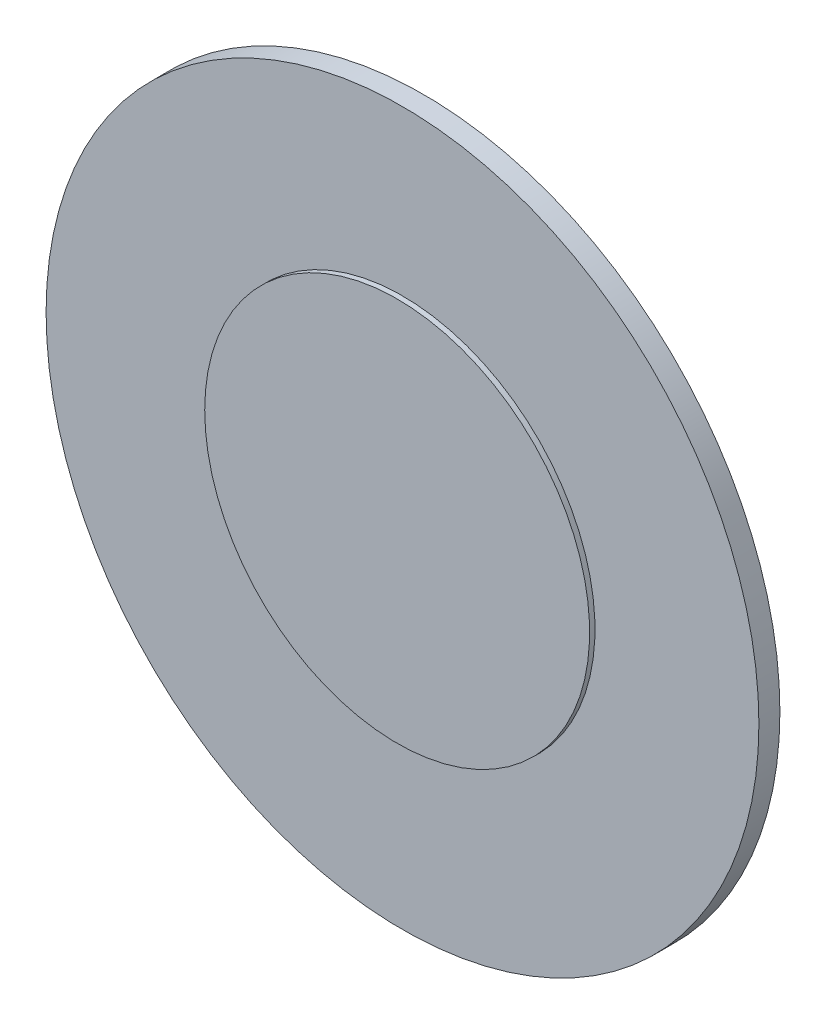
ISO-10303-21;
HEADER;
FILE_DESCRIPTION(('STEP AP214'),'2;1');
FILE_NAME('part.step','',(''),(''),'','','');
FILE_SCHEMA(('AUTOMOTIVE_DESIGN { 1 0 10303 214 1 1 1 1 }'));
ENDSEC;
DATA;
#1=APPLICATION_CONTEXT('core data for automotive mechanical design processes');
#2=APPLICATION_PROTOCOL_DEFINITION('international standard','automotive_design',2000,#1);
#3=PRODUCT_CONTEXT('',#1,'mechanical');
#4=PRODUCT('Part','Part','',(#3));
#5=PRODUCT_RELATED_PRODUCT_CATEGORY('part','',(#4));
#6=PRODUCT_DEFINITION_FORMATION('','',#4);
#7=PRODUCT_DEFINITION_CONTEXT('part definition',#1,'design');
#8=PRODUCT_DEFINITION('design','',#6,#7);
#9=PRODUCT_DEFINITION_SHAPE('','',#8);
#10=(LENGTH_UNIT() NAMED_UNIT(*) SI_UNIT(.MILLI.,.METRE.));
#11=(NAMED_UNIT(*) PLANE_ANGLE_UNIT() SI_UNIT($,.RADIAN.));
#12=(NAMED_UNIT(*) SI_UNIT($,.STERADIAN.) SOLID_ANGLE_UNIT());
#13=UNCERTAINTY_MEASURE_WITH_UNIT(LENGTH_MEASURE(1.E-05),#10,'distance_accuracy_value','');
#14=(GEOMETRIC_REPRESENTATION_CONTEXT(3) GLOBAL_UNCERTAINTY_ASSIGNED_CONTEXT((#13)) GLOBAL_UNIT_ASSIGNED_CONTEXT((#10,
#11,#12)) REPRESENTATION_CONTEXT('',''));
#15=CARTESIAN_POINT('',(0.,0.,0.));
#16=DIRECTION('',(0.,0.,1.));
#17=DIRECTION('',(1.,0.,0.));
#18=AXIS2_PLACEMENT_3D('',#15,#16,#17);
#19=CARTESIAN_POINT('',(0.,-1.94289029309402E-13,0.299999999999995));
#20=DIRECTION('',(0.,0.,0.999999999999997));
#21=DIRECTION('',(0.999999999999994,0.,0.));
#22=AXIS2_PLACEMENT_3D('',#19,#20,#21);
#23=PLANE('',#22);
#24=CARTESIAN_POINT('',(0.,-1.94289029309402E-13,0.299999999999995));
#25=DIRECTION('',(0.,0.,0.999999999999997));
#26=DIRECTION('',(0.999999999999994,0.,0.));
#27=AXIS2_PLACEMENT_3D('',#24,#25,#26);
#28=CIRCLE('',#27,5.0927);
#29=CARTESIAN_POINT('',(-5.09269999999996,-1.92875521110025E-13,0.299999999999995));
#30=VERTEX_POINT('',#29);
#31=EDGE_CURVE('E10',#30,#30,#28,.T.);
#32=ORIENTED_EDGE('',*,*,#31,.T.);
#33=EDGE_LOOP('',(#32));
#34=FACE_BOUND('',#33,.T.);
#35=CARTESIAN_POINT('',(0.,-1.94289029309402E-13,0.299999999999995));
#36=DIRECTION('',(0.,0.,0.999999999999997));
#37=DIRECTION('',(0.999999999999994,0.,0.));
#38=AXIS2_PLACEMENT_3D('',#35,#36,#37);
#39=CIRCLE('',#38,2.75);
#40=CARTESIAN_POINT('',(-2.74999999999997,-1.93525750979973E-13,0.299999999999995));
#41=VERTEX_POINT('',#40);
#42=EDGE_CURVE('E41',#41,#41,#39,.T.);
#43=ORIENTED_EDGE('',*,*,#42,.F.);
#44=EDGE_LOOP('',(#43));
#45=FACE_BOUND('',#44,.T.);
#46=ADVANCED_FACE('F28',(#34,#45),#23,.T.);
#47=CARTESIAN_POINT('',(0.,-1.94289029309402E-13,0.299999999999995));
#48=DIRECTION('',(0.,0.,-0.999999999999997));
#49=DIRECTION('',(-0.999999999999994,0.,0.));
#50=AXIS2_PLACEMENT_3D('',#47,#48,#49);
#51=CYLINDRICAL_SURFACE('',#50,5.0927);
#52=CARTESIAN_POINT('',(0.,-1.94289029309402E-13,0.));
#53=DIRECTION('',(0.,0.,0.999999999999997));
#54=DIRECTION('',(0.999999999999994,0.,0.));
#55=AXIS2_PLACEMENT_3D('',#52,#53,#54);
#56=CIRCLE('',#55,5.0927);
#57=CARTESIAN_POINT('',(-5.09269999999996,-1.92875521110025E-13,0.));
#58=VERTEX_POINT('',#57);
#59=EDGE_CURVE('E32',#58,#58,#56,.T.);
#60=CARTESIAN_POINT('',(-5.09269999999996,-1.92875521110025E-13,0.299999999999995));
#61=CARTESIAN_POINT('',(-5.09269999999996,-1.92875521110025E-13,0.296874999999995));
#62=CARTESIAN_POINT('',(-5.09269999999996,-1.92875521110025E-13,0.293749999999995));
#63=CARTESIAN_POINT('',(-5.09269999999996,-1.92875521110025E-13,0.287499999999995));
#64=CARTESIAN_POINT('',(-5.09269999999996,-1.92875521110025E-13,0.284374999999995));
#65=CARTESIAN_POINT('',(-5.09269999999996,-1.92875521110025E-13,0.278124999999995));
#66=CARTESIAN_POINT('',(-5.09269999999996,-1.92875521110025E-13,0.274999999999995));
#67=CARTESIAN_POINT('',(-5.09269999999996,-1.92875521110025E-13,0.268749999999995));
#68=CARTESIAN_POINT('',(-5.09269999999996,-1.92875521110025E-13,0.265624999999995));
#69=CARTESIAN_POINT('',(-5.09269999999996,-1.92875521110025E-13,0.259374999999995));
#70=CARTESIAN_POINT('',(-5.09269999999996,-1.92875521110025E-13,0.256249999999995));
#71=CARTESIAN_POINT('',(-5.09269999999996,-1.92875521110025E-13,0.249999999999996));
#72=CARTESIAN_POINT('',(-5.09269999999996,-1.92875521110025E-13,0.246874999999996));
#73=CARTESIAN_POINT('',(-5.09269999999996,-1.92875521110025E-13,0.240624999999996));
#74=CARTESIAN_POINT('',(-5.09269999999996,-1.92875521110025E-13,0.237499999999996));
#75=CARTESIAN_POINT('',(-5.09269999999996,-1.92875521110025E-13,0.231249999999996));
#76=CARTESIAN_POINT('',(-5.09269999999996,-1.92875521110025E-13,0.228124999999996));
#77=CARTESIAN_POINT('',(-5.09269999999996,-1.92875521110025E-13,0.221874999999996));
#78=CARTESIAN_POINT('',(-5.09269999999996,-1.92875521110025E-13,0.218749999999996));
#79=CARTESIAN_POINT('',(-5.09269999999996,-1.92875521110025E-13,0.212499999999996));
#80=CARTESIAN_POINT('',(-5.09269999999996,-1.92875521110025E-13,0.209374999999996));
#81=CARTESIAN_POINT('',(-5.09269999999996,-1.92875521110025E-13,0.203124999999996));
#82=CARTESIAN_POINT('',(-5.09269999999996,-1.92875521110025E-13,0.199999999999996));
#83=CARTESIAN_POINT('',(-5.09269999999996,-1.92875521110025E-13,0.193749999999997));
#84=CARTESIAN_POINT('',(-5.09269999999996,-1.92875521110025E-13,0.190624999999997));
#85=CARTESIAN_POINT('',(-5.09269999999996,-1.92875521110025E-13,0.184374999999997));
#86=CARTESIAN_POINT('',(-5.09269999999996,-1.92875521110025E-13,0.181249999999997));
#87=CARTESIAN_POINT('',(-5.09269999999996,-1.92875521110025E-13,0.174999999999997));
#88=CARTESIAN_POINT('',(-5.09269999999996,-1.92875521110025E-13,0.171874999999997));
#89=CARTESIAN_POINT('',(-5.09269999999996,-1.92875521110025E-13,0.165624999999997));
#90=CARTESIAN_POINT('',(-5.09269999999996,-1.92875521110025E-13,0.162499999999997));
#91=CARTESIAN_POINT('',(-5.09269999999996,-1.92875521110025E-13,0.156249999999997));
#92=CARTESIAN_POINT('',(-5.09269999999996,-1.92875521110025E-13,0.153124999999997));
#93=CARTESIAN_POINT('',(-5.09269999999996,-1.92875521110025E-13,0.146874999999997));
#94=CARTESIAN_POINT('',(-5.09269999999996,-1.92875521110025E-13,0.143749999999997));
#95=CARTESIAN_POINT('',(-5.09269999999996,-1.92875521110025E-13,0.137499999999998));
#96=CARTESIAN_POINT('',(-5.09269999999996,-1.92875521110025E-13,0.134374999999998));
#97=CARTESIAN_POINT('',(-5.09269999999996,-1.92875521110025E-13,0.128124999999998));
#98=CARTESIAN_POINT('',(-5.09269999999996,-1.92875521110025E-13,0.124999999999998));
#99=CARTESIAN_POINT('',(-5.09269999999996,-1.92875521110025E-13,0.118749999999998));
#100=CARTESIAN_POINT('',(-5.09269999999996,-1.92875521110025E-13,0.115624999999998));
#101=CARTESIAN_POINT('',(-5.09269999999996,-1.92875521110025E-13,0.109374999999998));
#102=CARTESIAN_POINT('',(-5.09269999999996,-1.92875521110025E-13,0.106249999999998));
#103=CARTESIAN_POINT('',(-5.09269999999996,-1.92875521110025E-13,0.0999999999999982));
#104=CARTESIAN_POINT('',(-5.09269999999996,-1.92875521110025E-13,0.0968749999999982));
#105=CARTESIAN_POINT('',(-5.09269999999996,-1.92875521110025E-13,0.0906249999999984));
#106=CARTESIAN_POINT('',(-5.09269999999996,-1.92875521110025E-13,0.0874999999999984));
#107=CARTESIAN_POINT('',(-5.09269999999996,-1.92875521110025E-13,0.0812499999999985));
#108=CARTESIAN_POINT('',(-5.09269999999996,-1.92875521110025E-13,0.0781249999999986));
#109=CARTESIAN_POINT('',(-5.09269999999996,-1.92875521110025E-13,0.0718749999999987));
#110=CARTESIAN_POINT('',(-5.09269999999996,-1.92875521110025E-13,0.0687499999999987));
#111=CARTESIAN_POINT('',(-5.09269999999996,-1.92875521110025E-13,0.0624999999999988));
#112=CARTESIAN_POINT('',(-5.09269999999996,-1.92875521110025E-13,0.0593749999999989));
#113=CARTESIAN_POINT('',(-5.09269999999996,-1.92875521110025E-13,0.053124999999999));
#114=CARTESIAN_POINT('',(-5.09269999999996,-1.92875521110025E-13,0.0499999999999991));
#115=CARTESIAN_POINT('',(-5.09269999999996,-1.92875521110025E-13,0.0437499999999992));
#116=CARTESIAN_POINT('',(-5.09269999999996,-1.92875521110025E-13,0.0406249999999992));
#117=CARTESIAN_POINT('',(-5.09269999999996,-1.92875521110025E-13,0.0343749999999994));
#118=CARTESIAN_POINT('',(-5.09269999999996,-1.92875521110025E-13,0.0312499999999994));
#119=CARTESIAN_POINT('',(-5.09269999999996,-1.92875521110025E-13,0.0249999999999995));
#120=CARTESIAN_POINT('',(-5.09269999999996,-1.92875521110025E-13,0.0218749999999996));
#121=CARTESIAN_POINT('',(-5.09269999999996,-1.92875521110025E-13,0.0156249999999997));
#122=CARTESIAN_POINT('',(-5.09269999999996,-1.92875521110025E-13,0.0124999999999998));
#123=CARTESIAN_POINT('',(-5.09269999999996,-1.92875521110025E-13,0.00624999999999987));
#124=CARTESIAN_POINT('',(-5.09269999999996,-1.92875521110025E-13,0.00312499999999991));
#125=CARTESIAN_POINT('',(-5.09269999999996,-1.92875521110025E-13,0.));
#126=B_SPLINE_CURVE_WITH_KNOTS('',3,(#60,#61,#62,#63,#64,#65,#66,#67,#68,#69,#70,#71,#72,#73,
#74,#75,#76,#77,#78,#79,#80,#81,#82,#83,#84,#85,#86,#87,#88,#89,#90,#91,#92,#93,#94,#95,#96,#97,
#98,#99,#100,#101,#102,#103,#104,#105,#106,#107,#108,#109,#110,#111,#112,#113,#114,#115,#116,
#117,#118,#119,#120,#121,#122,#123,#124,#125),.UNSPECIFIED.,.F.,.F.,(4,2,2,2,2,2,2,2,2,2,2,2,2,
2,2,2,2,2,2,2,2,2,2,2,2,2,2,2,2,2,2,2,4),(0.,0.00937499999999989,0.0187499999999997,
0.0281249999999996,0.0374999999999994,0.0468749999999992,0.056249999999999,0.0656249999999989,
0.0749999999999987,0.0843749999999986,0.0937499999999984,0.103124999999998,0.112499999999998,
0.121874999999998,0.131249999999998,0.140624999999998,0.149999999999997,0.159374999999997,
0.168749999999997,0.178124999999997,0.187499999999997,0.196874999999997,0.206249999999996,
0.215624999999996,0.224999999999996,0.234374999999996,0.243749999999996,0.253124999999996,
0.262499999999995,0.271874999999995,0.281249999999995,0.290624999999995,0.299999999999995),.UNSPECIFIED.);
#127=EDGE_CURVE('BSEAM30',#30,#58,#126,.T.);
#128=ORIENTED_EDGE('',*,*,#31,.F.);
#129=ORIENTED_EDGE('',*,*,#59,.T.);
#130=ORIENTED_EDGE('',*,*,#127,.T.);
#131=ORIENTED_EDGE('',*,*,#127,.F.);
#132=EDGE_LOOP('',(#128,#130,#129,#131));
#133=FACE_BOUND('',#132,.T.);
#134=ADVANCED_FACE('F30',(#133),#51,.T.);
#135=CARTESIAN_POINT('',(0.,-1.94289029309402E-13,0.));
#136=DIRECTION('',(0.,0.,0.999999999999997));
#137=DIRECTION('',(0.999999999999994,0.,0.));
#138=AXIS2_PLACEMENT_3D('',#135,#136,#137);
#139=PLANE('',#138);
#140=ORIENTED_EDGE('',*,*,#59,.F.);
#141=EDGE_LOOP('',(#140));
#142=FACE_BOUND('',#141,.T.);
#143=ADVANCED_FACE('F52',(#142),#139,.F.);
#144=CARTESIAN_POINT('',(0.,-1.94289029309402E-13,0.376199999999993));
#145=DIRECTION('',(0.,0.,-0.999999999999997));
#146=DIRECTION('',(-0.999999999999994,0.,0.));
#147=AXIS2_PLACEMENT_3D('',#144,#145,#146);
#148=CYLINDRICAL_SURFACE('',#147,2.75);
#149=CARTESIAN_POINT('',(0.,-1.94289029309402E-13,0.376199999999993));
#150=DIRECTION('',(0.,0.,0.999999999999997));
#151=DIRECTION('',(0.999999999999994,0.,0.));
#152=AXIS2_PLACEMENT_3D('',#149,#150,#151);
#153=CIRCLE('',#152,2.75);
#154=CARTESIAN_POINT('',(-2.74999999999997,-1.93525750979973E-13,0.376199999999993));
#155=VERTEX_POINT('',#154);
#156=EDGE_CURVE('E39',#155,#155,#153,.T.);
#157=CARTESIAN_POINT('',(-2.74999999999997,-1.93525750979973E-13,0.376199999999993));
#158=CARTESIAN_POINT('',(-2.74999999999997,-1.93525750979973E-13,0.375406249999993));
#159=CARTESIAN_POINT('',(-2.74999999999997,-1.93525750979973E-13,0.374612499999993));
#160=CARTESIAN_POINT('',(-2.74999999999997,-1.93525750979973E-13,0.373024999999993));
#161=CARTESIAN_POINT('',(-2.74999999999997,-1.93525750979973E-13,0.372231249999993));
#162=CARTESIAN_POINT('',(-2.74999999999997,-1.93525750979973E-13,0.370643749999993));
#163=CARTESIAN_POINT('',(-2.74999999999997,-1.93525750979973E-13,0.369849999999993));
#164=CARTESIAN_POINT('',(-2.74999999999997,-1.93525750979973E-13,0.368262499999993));
#165=CARTESIAN_POINT('',(-2.74999999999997,-1.93525750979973E-13,0.367468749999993));
#166=CARTESIAN_POINT('',(-2.74999999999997,-1.93525750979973E-13,0.365881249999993));
#167=CARTESIAN_POINT('',(-2.74999999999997,-1.93525750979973E-13,0.365087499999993));
#168=CARTESIAN_POINT('',(-2.74999999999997,-1.93525750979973E-13,0.363499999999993));
#169=CARTESIAN_POINT('',(-2.74999999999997,-1.93525750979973E-13,0.362706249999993));
#170=CARTESIAN_POINT('',(-2.74999999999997,-1.93525750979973E-13,0.361118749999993));
#171=CARTESIAN_POINT('',(-2.74999999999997,-1.93525750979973E-13,0.360324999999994));
#172=CARTESIAN_POINT('',(-2.74999999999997,-1.93525750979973E-13,0.358737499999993));
#173=CARTESIAN_POINT('',(-2.74999999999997,-1.93525750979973E-13,0.357943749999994));
#174=CARTESIAN_POINT('',(-2.74999999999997,-1.93525750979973E-13,0.356356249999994));
#175=CARTESIAN_POINT('',(-2.74999999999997,-1.93525750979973E-13,0.355562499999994));
#176=CARTESIAN_POINT('',(-2.74999999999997,-1.93525750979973E-13,0.353974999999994));
#177=CARTESIAN_POINT('',(-2.74999999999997,-1.93525750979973E-13,0.353181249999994));
#178=CARTESIAN_POINT('',(-2.74999999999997,-1.93525750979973E-13,0.351593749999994));
#179=CARTESIAN_POINT('',(-2.74999999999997,-1.93525750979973E-13,0.350799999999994));
#180=CARTESIAN_POINT('',(-2.74999999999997,-1.93525750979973E-13,0.349212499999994));
#181=CARTESIAN_POINT('',(-2.74999999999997,-1.93525750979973E-13,0.348418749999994));
#182=CARTESIAN_POINT('',(-2.74999999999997,-1.93525750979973E-13,0.346831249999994));
#183=CARTESIAN_POINT('',(-2.74999999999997,-1.93525750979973E-13,0.346037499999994));
#184=CARTESIAN_POINT('',(-2.74999999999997,-1.93525750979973E-13,0.344449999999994));
#185=CARTESIAN_POINT('',(-2.74999999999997,-1.93525750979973E-13,0.343656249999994));
#186=CARTESIAN_POINT('',(-2.74999999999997,-1.93525750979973E-13,0.342068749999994));
#187=CARTESIAN_POINT('',(-2.74999999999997,-1.93525750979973E-13,0.341274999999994));
#188=CARTESIAN_POINT('',(-2.74999999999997,-1.93525750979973E-13,0.339687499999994));
#189=CARTESIAN_POINT('',(-2.74999999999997,-1.93525750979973E-13,0.338893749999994));
#190=CARTESIAN_POINT('',(-2.74999999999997,-1.93525750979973E-13,0.337306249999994));
#191=CARTESIAN_POINT('',(-2.74999999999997,-1.93525750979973E-13,0.336512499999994));
#192=CARTESIAN_POINT('',(-2.74999999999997,-1.93525750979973E-13,0.334924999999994));
#193=CARTESIAN_POINT('',(-2.74999999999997,-1.93525750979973E-13,0.334131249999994));
#194=CARTESIAN_POINT('',(-2.74999999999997,-1.93525750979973E-13,0.332543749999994));
#195=CARTESIAN_POINT('',(-2.74999999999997,-1.93525750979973E-13,0.331749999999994));
#196=CARTESIAN_POINT('',(-2.74999999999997,-1.93525750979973E-13,0.330162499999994));
#197=CARTESIAN_POINT('',(-2.74999999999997,-1.93525750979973E-13,0.329368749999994));
#198=CARTESIAN_POINT('',(-2.74999999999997,-1.93525750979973E-13,0.327781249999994));
#199=CARTESIAN_POINT('',(-2.74999999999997,-1.93525750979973E-13,0.326987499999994));
#200=CARTESIAN_POINT('',(-2.74999999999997,-1.93525750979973E-13,0.325399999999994));
#201=CARTESIAN_POINT('',(-2.74999999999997,-1.93525750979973E-13,0.324606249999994));
#202=CARTESIAN_POINT('',(-2.74999999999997,-1.93525750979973E-13,0.323018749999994));
#203=CARTESIAN_POINT('',(-2.74999999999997,-1.93525750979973E-13,0.322224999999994));
#204=CARTESIAN_POINT('',(-2.74999999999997,-1.93525750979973E-13,0.320637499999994));
#205=CARTESIAN_POINT('',(-2.74999999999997,-1.93525750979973E-13,0.319843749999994));
#206=CARTESIAN_POINT('',(-2.74999999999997,-1.93525750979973E-13,0.318256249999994));
#207=CARTESIAN_POINT('',(-2.74999999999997,-1.93525750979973E-13,0.317462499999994));
#208=CARTESIAN_POINT('',(-2.74999999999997,-1.93525750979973E-13,0.315874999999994));
#209=CARTESIAN_POINT('',(-2.74999999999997,-1.93525750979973E-13,0.315081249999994));
#210=CARTESIAN_POINT('',(-2.74999999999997,-1.93525750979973E-13,0.313493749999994));
#211=CARTESIAN_POINT('',(-2.74999999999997,-1.93525750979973E-13,0.312699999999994));
#212=CARTESIAN_POINT('',(-2.74999999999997,-1.93525750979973E-13,0.311112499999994));
#213=CARTESIAN_POINT('',(-2.74999999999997,-1.93525750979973E-13,0.310318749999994));
#214=CARTESIAN_POINT('',(-2.74999999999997,-1.93525750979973E-13,0.308731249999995));
#215=CARTESIAN_POINT('',(-2.74999999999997,-1.93525750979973E-13,0.307937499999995));
#216=CARTESIAN_POINT('',(-2.74999999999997,-1.93525750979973E-13,0.306349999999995));
#217=CARTESIAN_POINT('',(-2.74999999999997,-1.93525750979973E-13,0.305556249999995));
#218=CARTESIAN_POINT('',(-2.74999999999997,-1.93525750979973E-13,0.303968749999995));
#219=CARTESIAN_POINT('',(-2.74999999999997,-1.93525750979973E-13,0.303174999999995));
#220=CARTESIAN_POINT('',(-2.74999999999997,-1.93525750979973E-13,0.301587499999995));
#221=CARTESIAN_POINT('',(-2.74999999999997,-1.93525750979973E-13,0.300793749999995));
#222=CARTESIAN_POINT('',(-2.74999999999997,-1.93525750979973E-13,0.299999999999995));
#223=B_SPLINE_CURVE_WITH_KNOTS('',3,(#157,#158,#159,#160,#161,#162,#163,#164,#165,#166,#167,
#168,#169,#170,#171,#172,#173,#174,#175,#176,#177,#178,#179,#180,#181,#182,#183,#184,#185,#186,
#187,#188,#189,#190,#191,#192,#193,#194,#195,#196,#197,#198,#199,#200,#201,#202,#203,#204,#205,
#206,#207,#208,#209,#210,#211,#212,#213,#214,#215,#216,#217,#218,#219,#220,#221,#222),
.UNSPECIFIED.,.F.,.F.,(4,2,2,2,2,2,2,2,2,2,2,2,2,2,2,2,2,2,2,2,2,2,2,2,2,2,2,2,2,2,2,2,4),(0.,
0.00238124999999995,0.00476249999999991,0.00714374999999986,0.00952499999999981,
0.0119062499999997,0.0142874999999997,0.0166687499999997,0.0190499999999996,0.0214312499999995,
0.0238124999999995,0.0261937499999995,0.0285749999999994,0.0309562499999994,0.0333374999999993,
0.0357187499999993,0.0380999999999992,0.0404812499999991,0.0428624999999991,0.045243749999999,
0.047624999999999,0.050006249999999,0.052387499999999,0.0547687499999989,0.0571499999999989,
0.0595312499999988,0.0619124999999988,0.0642937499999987,0.0666749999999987,0.0690562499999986,
0.0714374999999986,0.0738187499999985,0.0761999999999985),.UNSPECIFIED.);
#224=EDGE_CURVE('BSEAM49',#155,#41,#223,.T.);
#225=ORIENTED_EDGE('',*,*,#156,.F.);
#226=ORIENTED_EDGE('',*,*,#42,.T.);
#227=ORIENTED_EDGE('',*,*,#224,.T.);
#228=ORIENTED_EDGE('',*,*,#224,.F.);
#229=EDGE_LOOP('',(#225,#227,#226,#228));
#230=FACE_BOUND('',#229,.T.);
#231=ADVANCED_FACE('F49',(#230),#148,.T.);
#232=CARTESIAN_POINT('',(0.,-1.94289029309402E-13,0.376199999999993));
#233=DIRECTION('',(0.,0.,0.999999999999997));
#234=DIRECTION('',(0.999999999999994,0.,0.));
#235=AXIS2_PLACEMENT_3D('',#232,#233,#234);
#236=PLANE('',#235);
#237=ORIENTED_EDGE('',*,*,#156,.T.);
#238=EDGE_LOOP('',(#237));
#239=FACE_BOUND('',#238,.T.);
#240=ADVANCED_FACE('F47',(#239),#236,.T.);
#241=CLOSED_SHELL('',(#46,#134,#143,#231,#240));
#242=MANIFOLD_SOLID_BREP('B2',#241);
#243=ADVANCED_BREP_SHAPE_REPRESENTATION('',(#18,#242),#14);
#244=SHAPE_DEFINITION_REPRESENTATION(#9,#243);
ENDSEC;
END-ISO-10303-21;
